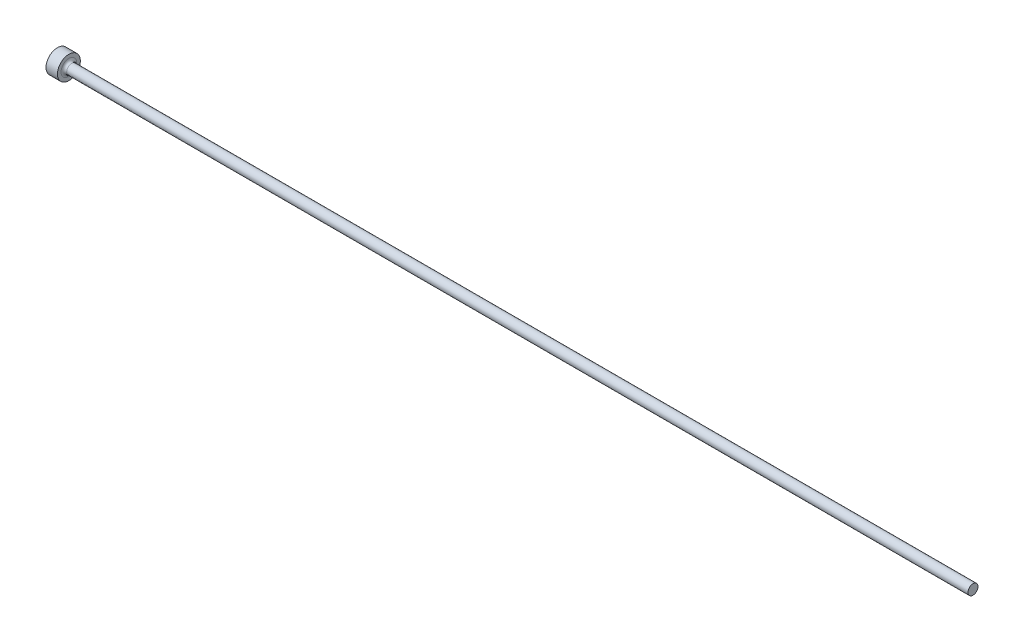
ISO-10303-21;
HEADER;
FILE_DESCRIPTION(('STEP AP214'),'2;1');
FILE_NAME('part.step','',(''),(''),'','','');
FILE_SCHEMA(('AUTOMOTIVE_DESIGN { 1 0 10303 214 1 1 1 1 }'));
ENDSEC;
DATA;
#1=APPLICATION_CONTEXT('core data for automotive mechanical design processes');
#2=APPLICATION_PROTOCOL_DEFINITION('international standard','automotive_design',2000,#1);
#3=PRODUCT_CONTEXT('',#1,'mechanical');
#4=PRODUCT('Part','Part','',(#3));
#5=PRODUCT_RELATED_PRODUCT_CATEGORY('part','',(#4));
#6=PRODUCT_DEFINITION_FORMATION('','',#4);
#7=PRODUCT_DEFINITION_CONTEXT('part definition',#1,'design');
#8=PRODUCT_DEFINITION('design','',#6,#7);
#9=PRODUCT_DEFINITION_SHAPE('','',#8);
#10=(LENGTH_UNIT() NAMED_UNIT(*) SI_UNIT(.MILLI.,.METRE.));
#11=(NAMED_UNIT(*) PLANE_ANGLE_UNIT() SI_UNIT($,.RADIAN.));
#12=(NAMED_UNIT(*) SI_UNIT($,.STERADIAN.) SOLID_ANGLE_UNIT());
#13=UNCERTAINTY_MEASURE_WITH_UNIT(LENGTH_MEASURE(1.E-05),#10,'distance_accuracy_value','');
#14=(GEOMETRIC_REPRESENTATION_CONTEXT(3) GLOBAL_UNCERTAINTY_ASSIGNED_CONTEXT((#13)) GLOBAL_UNIT_ASSIGNED_CONTEXT((#10,
#11,#12)) REPRESENTATION_CONTEXT('',''));
#15=CARTESIAN_POINT('',(0.,0.,0.));
#16=DIRECTION('',(0.,0.,1.));
#17=DIRECTION('',(1.,0.,0.));
#18=AXIS2_PLACEMENT_3D('',#15,#16,#17);
#19=CARTESIAN_POINT('',(0.,0.,0.));
#20=DIRECTION('',(1.,0.,0.));
#21=DIRECTION('',(0.,1.,0.));
#22=AXIS2_PLACEMENT_3D('',#19,#20,#21);
#23=PLANE('',#22);
#24=CARTESIAN_POINT('',(0.,0.,0.));
#25=DIRECTION('',(-1.,0.,0.));
#26=DIRECTION('',(0.,-1.,0.));
#27=AXIS2_PLACEMENT_3D('',#24,#25,#26);
#28=CIRCLE('',#27,3.17499999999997);
#29=CARTESIAN_POINT('',(0.,-3.17499999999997,0.));
#30=VERTEX_POINT('',#29);
#31=EDGE_CURVE('E10',#30,#30,#28,.T.);
#32=ORIENTED_EDGE('',*,*,#31,.T.);
#33=EDGE_LOOP('',(#32));
#34=FACE_BOUND('',#33,.T.);
#35=ADVANCED_FACE('F29',(#34),#23,.F.);
#36=CARTESIAN_POINT('',(254.,0.,0.));
#37=DIRECTION('',(-1.,0.,0.));
#38=DIRECTION('',(0.,-1.,0.));
#39=AXIS2_PLACEMENT_3D('',#36,#37,#38);
#40=CYLINDRICAL_SURFACE('',#39,3.17499999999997);
#41=ORIENTED_EDGE('',*,*,#31,.F.);
#42=EDGE_LOOP('',(#41));
#43=FACE_BOUND('',#42,.T.);
#44=CARTESIAN_POINT('',(3.17499999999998,0.,0.));
#45=DIRECTION('',(-1.,0.,0.));
#46=DIRECTION('',(0.,-1.,0.));
#47=AXIS2_PLACEMENT_3D('',#44,#45,#46);
#48=CIRCLE('',#47,3.17499999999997);
#49=CARTESIAN_POINT('',(3.17499999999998,-3.17499999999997,0.));
#50=VERTEX_POINT('',#49);
#51=EDGE_CURVE('E35',#50,#50,#48,.T.);
#52=ORIENTED_EDGE('',*,*,#51,.T.);
#53=EDGE_LOOP('',(#52));
#54=FACE_BOUND('',#53,.T.);
#55=ADVANCED_FACE('F64',(#43,#54),#40,.T.);
#56=CARTESIAN_POINT('',(3.175,3.17499999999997,0.));
#57=DIRECTION('',(-1.,0.,0.));
#58=DIRECTION('',(0.,-1.,0.));
#59=AXIS2_PLACEMENT_3D('',#56,#57,#58);
#60=PLANE('',#59);
#61=ORIENTED_EDGE('',*,*,#51,.F.);
#62=EDGE_LOOP('',(#61));
#63=FACE_BOUND('',#62,.T.);
#64=CARTESIAN_POINT('',(3.17499999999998,0.,0.));
#65=DIRECTION('',(-1.,0.,0.));
#66=DIRECTION('',(0.,-1.,0.));
#67=AXIS2_PLACEMENT_3D('',#64,#65,#66);
#68=CIRCLE('',#67,2.17551);
#69=CARTESIAN_POINT('',(3.17499999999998,-2.17551,0.));
#70=VERTEX_POINT('',#69);
#71=EDGE_CURVE('E39',#70,#70,#68,.T.);
#72=ORIENTED_EDGE('',*,*,#71,.T.);
#73=EDGE_LOOP('',(#72));
#74=FACE_BOUND('',#73,.T.);
#75=ADVANCED_FACE('F68',(#63,#74),#60,.F.);
#76=CARTESIAN_POINT('',(3.9624,0.,0.));
#77=DIRECTION('',(-1.,0.,0.));
#78=DIRECTION('',(0.,-1.,0.));
#79=AXIS2_PLACEMENT_3D('',#76,#77,#78);
#80=TOROIDAL_SURFACE('',#79,2.17551,0.7874);
#81=ORIENTED_EDGE('',*,*,#71,.F.);
#82=EDGE_LOOP('',(#81));
#83=FACE_BOUND('',#82,.T.);
#84=CARTESIAN_POINT('',(3.96239999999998,0.,0.));
#85=DIRECTION('',(-1.,0.,0.));
#86=DIRECTION('',(0.,-1.,0.));
#87=AXIS2_PLACEMENT_3D('',#84,#85,#86);
#88=CIRCLE('',#87,1.38811);
#89=CARTESIAN_POINT('',(3.96239999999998,-1.38811,0.));
#90=VERTEX_POINT('',#89);
#91=EDGE_CURVE('E43',#90,#90,#88,.T.);
#92=ORIENTED_EDGE('',*,*,#91,.T.);
#93=EDGE_LOOP('',(#92));
#94=FACE_BOUND('',#93,.T.);
#95=ADVANCED_FACE('F60',(#83,#94),#80,.F.);
#96=CARTESIAN_POINT('',(254.,0.,0.));
#97=DIRECTION('',(-1.,0.,0.));
#98=DIRECTION('',(0.,-1.,0.));
#99=AXIS2_PLACEMENT_3D('',#96,#97,#98);
#100=CYLINDRICAL_SURFACE('',#99,1.38810999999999);
#101=ORIENTED_EDGE('',*,*,#91,.F.);
#102=EDGE_LOOP('',(#101));
#103=FACE_BOUND('',#102,.T.);
#104=CARTESIAN_POINT('',(254.,0.,0.));
#105=DIRECTION('',(-1.,0.,0.));
#106=DIRECTION('',(0.,-1.,0.));
#107=AXIS2_PLACEMENT_3D('',#104,#105,#106);
#108=CIRCLE('',#107,1.38810999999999);
#109=CARTESIAN_POINT('',(254.,-1.38810999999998,0.));
#110=VERTEX_POINT('',#109);
#111=EDGE_CURVE('E48',#110,#110,#108,.T.);
#112=ORIENTED_EDGE('',*,*,#111,.T.);
#113=EDGE_LOOP('',(#112));
#114=FACE_BOUND('',#113,.T.);
#115=ADVANCED_FACE('F52',(#103,#114),#100,.T.);
#116=CARTESIAN_POINT('',(254.,1.38811,0.));
#117=DIRECTION('',(-1.,0.,0.));
#118=DIRECTION('',(0.,-1.,0.));
#119=AXIS2_PLACEMENT_3D('',#116,#117,#118);
#120=PLANE('',#119);
#121=ORIENTED_EDGE('',*,*,#111,.F.);
#122=EDGE_LOOP('',(#121));
#123=FACE_BOUND('',#122,.T.);
#124=ADVANCED_FACE('F54',(#123),#120,.F.);
#125=CLOSED_SHELL('',(#35,#55,#75,#95,#115,#124));
#126=MANIFOLD_SOLID_BREP('B2',#125);
#127=ADVANCED_BREP_SHAPE_REPRESENTATION('',(#18,#126),#14);
#128=SHAPE_DEFINITION_REPRESENTATION(#9,#127);
ENDSEC;
END-ISO-10303-21;
